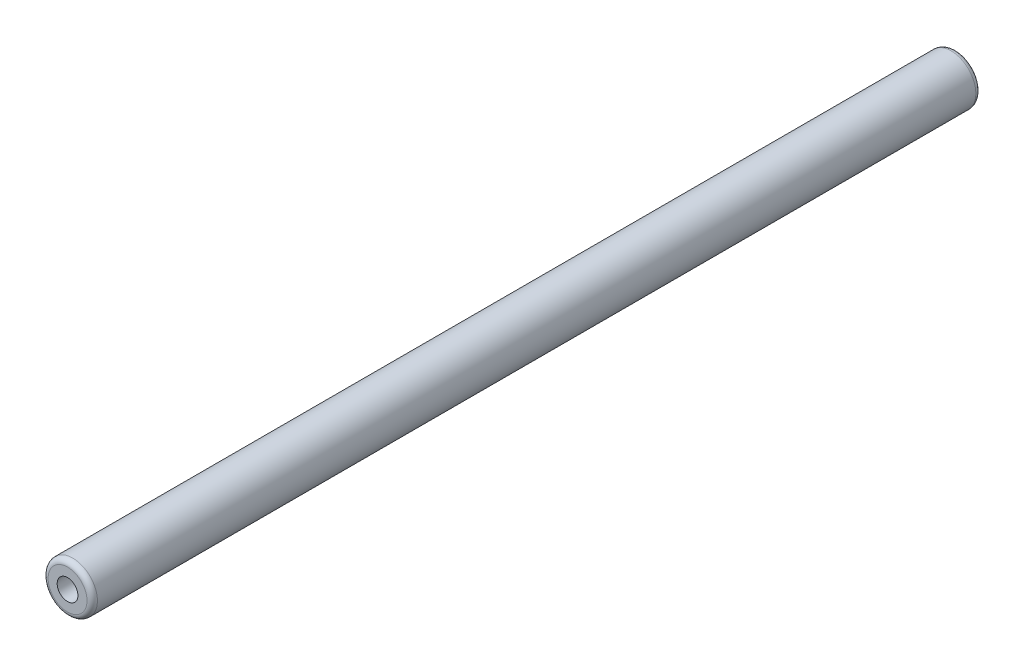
ISO-10303-21;
HEADER;
FILE_DESCRIPTION(('STEP AP214'),'2;1');
FILE_NAME('part.step','',(''),(''),'','','');
FILE_SCHEMA(('AUTOMOTIVE_DESIGN { 1 0 10303 214 1 1 1 1 }'));
ENDSEC;
DATA;
#1=APPLICATION_CONTEXT('core data for automotive mechanical design processes');
#2=APPLICATION_PROTOCOL_DEFINITION('international standard','automotive_design',2000,#1);
#3=PRODUCT_CONTEXT('',#1,'mechanical');
#4=PRODUCT('Part','Part','',(#3));
#5=PRODUCT_RELATED_PRODUCT_CATEGORY('part','',(#4));
#6=PRODUCT_DEFINITION_FORMATION('','',#4);
#7=PRODUCT_DEFINITION_CONTEXT('part definition',#1,'design');
#8=PRODUCT_DEFINITION('design','',#6,#7);
#9=PRODUCT_DEFINITION_SHAPE('','',#8);
#10=(LENGTH_UNIT() NAMED_UNIT(*) SI_UNIT(.MILLI.,.METRE.));
#11=(NAMED_UNIT(*) PLANE_ANGLE_UNIT() SI_UNIT($,.RADIAN.));
#12=(NAMED_UNIT(*) SI_UNIT($,.STERADIAN.) SOLID_ANGLE_UNIT());
#13=UNCERTAINTY_MEASURE_WITH_UNIT(LENGTH_MEASURE(1.E-05),#10,'distance_accuracy_value','');
#14=(GEOMETRIC_REPRESENTATION_CONTEXT(3) GLOBAL_UNCERTAINTY_ASSIGNED_CONTEXT((#13)) GLOBAL_UNIT_ASSIGNED_CONTEXT((#10,
#11,#12)) REPRESENTATION_CONTEXT('',''));
#15=CARTESIAN_POINT('',(0.,0.,0.));
#16=DIRECTION('',(0.,0.,1.));
#17=DIRECTION('',(1.,0.,0.));
#18=AXIS2_PLACEMENT_3D('',#15,#16,#17);
#19=CARTESIAN_POINT('',(0.,0.,171.25));
#20=DIRECTION('',(0.,0.,-1.));
#21=DIRECTION('',(-1.,0.,0.));
#22=AXIS2_PLACEMENT_3D('',#19,#20,#21);
#23=CYLINDRICAL_SURFACE('',#22,9.5);
#24=CARTESIAN_POINT('',(0.,0.,-169.25));
#25=DIRECTION('',(0.,0.,1.));
#26=DIRECTION('',(1.,0.,0.));
#27=AXIS2_PLACEMENT_3D('',#24,#25,#26);
#28=CIRCLE('',#27,9.5);
#29=CARTESIAN_POINT('',(9.5,0.,-169.25));
#30=VERTEX_POINT('',#29);
#31=EDGE_CURVE('E24',#30,#30,#28,.T.);
#32=ORIENTED_EDGE('',*,*,#31,.T.);
#33=EDGE_LOOP('',(#32));
#34=FACE_BOUND('',#33,.T.);
#35=CARTESIAN_POINT('',(0.,0.,169.25));
#36=DIRECTION('',(0.,0.,1.));
#37=DIRECTION('',(1.,0.,0.));
#38=AXIS2_PLACEMENT_3D('',#35,#36,#37);
#39=CIRCLE('',#38,9.5);
#40=CARTESIAN_POINT('',(9.5,0.,169.25));
#41=VERTEX_POINT('',#40);
#42=EDGE_CURVE('E28',#41,#41,#39,.F.);
#43=ORIENTED_EDGE('',*,*,#42,.T.);
#44=EDGE_LOOP('',(#43));
#45=FACE_BOUND('',#44,.T.);
#46=ADVANCED_FACE('F14',(#34,#45),#23,.T.);
#47=CARTESIAN_POINT('',(0.,0.,171.25));
#48=DIRECTION('',(0.,0.,1.));
#49=DIRECTION('',(1.,0.,0.));
#50=AXIS2_PLACEMENT_3D('',#47,#48,#49);
#51=PLANE('',#50);
#52=CARTESIAN_POINT('',(0.,0.,171.25));
#53=DIRECTION('',(0.,0.,1.));
#54=DIRECTION('',(1.,0.,0.));
#55=AXIS2_PLACEMENT_3D('',#52,#53,#54);
#56=CIRCLE('',#55,7.5);
#57=CARTESIAN_POINT('',(7.5,0.,171.25));
#58=VERTEX_POINT('',#57);
#59=EDGE_CURVE('E10',#58,#58,#56,.T.);
#60=ORIENTED_EDGE('',*,*,#59,.T.);
#61=EDGE_LOOP('',(#60));
#62=FACE_BOUND('',#61,.T.);
#63=CARTESIAN_POINT('',(0.,0.,171.25));
#64=DIRECTION('',(0.,0.,1.));
#65=DIRECTION('',(1.,0.,0.));
#66=AXIS2_PLACEMENT_3D('',#63,#64,#65);
#67=CIRCLE('',#66,4.);
#68=CARTESIAN_POINT('',(4.,0.,171.25));
#69=VERTEX_POINT('',#68);
#70=EDGE_CURVE('E36',#69,#69,#67,.T.);
#71=ORIENTED_EDGE('',*,*,#70,.F.);
#72=EDGE_LOOP('',(#71));
#73=FACE_BOUND('',#72,.T.);
#74=ADVANCED_FACE('F51',(#62,#73),#51,.T.);
#75=CARTESIAN_POINT('',(0.,0.,-171.25));
#76=DIRECTION('',(0.,0.,1.));
#77=DIRECTION('',(1.,0.,0.));
#78=AXIS2_PLACEMENT_3D('',#75,#76,#77);
#79=PLANE('',#78);
#80=CARTESIAN_POINT('',(0.,0.,-171.25));
#81=DIRECTION('',(0.,0.,-1.));
#82=DIRECTION('',(-1.,0.,0.));
#83=AXIS2_PLACEMENT_3D('',#80,#81,#82);
#84=CIRCLE('',#83,4.);
#85=CARTESIAN_POINT('',(-4.,0.,-171.25));
#86=VERTEX_POINT('',#85);
#87=EDGE_CURVE('E42',#86,#86,#84,.T.);
#88=ORIENTED_EDGE('',*,*,#87,.F.);
#89=EDGE_LOOP('',(#88));
#90=FACE_BOUND('',#89,.T.);
#91=CARTESIAN_POINT('',(0.,0.,-171.25));
#92=DIRECTION('',(0.,0.,1.));
#93=DIRECTION('',(1.,0.,0.));
#94=AXIS2_PLACEMENT_3D('',#91,#92,#93);
#95=CIRCLE('',#94,7.5);
#96=CARTESIAN_POINT('',(7.5,0.,-171.25));
#97=VERTEX_POINT('',#96);
#98=EDGE_CURVE('E20',#97,#97,#95,.F.);
#99=ORIENTED_EDGE('',*,*,#98,.T.);
#100=EDGE_LOOP('',(#99));
#101=FACE_BOUND('',#100,.T.);
#102=ADVANCED_FACE('F48',(#90,#101),#79,.F.);
#103=CARTESIAN_POINT('',(0.,0.,146.25));
#104=DIRECTION('',(0.,0.,1.));
#105=DIRECTION('',(1.,0.,0.));
#106=AXIS2_PLACEMENT_3D('',#103,#104,#105);
#107=CYLINDRICAL_SURFACE('',#106,4.);
#108=CARTESIAN_POINT('',(0.,0.,146.25));
#109=DIRECTION('',(0.,0.,1.));
#110=DIRECTION('',(1.,0.,0.));
#111=AXIS2_PLACEMENT_3D('',#108,#109,#110);
#112=CIRCLE('',#111,4.);
#113=CARTESIAN_POINT('',(4.,0.,146.25));
#114=VERTEX_POINT('',#113);
#115=EDGE_CURVE('E33',#114,#114,#112,.T.);
#116=ORIENTED_EDGE('',*,*,#115,.F.);
#117=EDGE_LOOP('',(#116));
#118=FACE_BOUND('',#117,.T.);
#119=ORIENTED_EDGE('',*,*,#70,.T.);
#120=EDGE_LOOP('',(#119));
#121=FACE_BOUND('',#120,.T.);
#122=ADVANCED_FACE('F50',(#118,#121),#107,.F.);
#123=CARTESIAN_POINT('',(0.,0.,146.25));
#124=DIRECTION('',(0.,0.,1.));
#125=DIRECTION('',(1.,0.,0.));
#126=AXIS2_PLACEMENT_3D('',#123,#124,#125);
#127=PLANE('',#126);
#128=ORIENTED_EDGE('',*,*,#115,.T.);
#129=EDGE_LOOP('',(#128));
#130=FACE_BOUND('',#129,.T.);
#131=ADVANCED_FACE('F59',(#130),#127,.T.);
#132=CARTESIAN_POINT('',(0.,0.,-169.25));
#133=DIRECTION('',(0.,0.,1.));
#134=DIRECTION('',(1.,0.,0.));
#135=AXIS2_PLACEMENT_3D('',#132,#133,#134);
#136=TOROIDAL_SURFACE('',#135,7.5,2.);
#137=ORIENTED_EDGE('',*,*,#98,.F.);
#138=EDGE_LOOP('',(#137));
#139=FACE_BOUND('',#138,.T.);
#140=ORIENTED_EDGE('',*,*,#31,.F.);
#141=EDGE_LOOP('',(#140));
#142=FACE_BOUND('',#141,.T.);
#143=ADVANCED_FACE('F74',(#139,#142),#136,.T.);
#144=CARTESIAN_POINT('',(0.,0.,169.25));
#145=DIRECTION('',(0.,0.,1.));
#146=DIRECTION('',(1.,0.,0.));
#147=AXIS2_PLACEMENT_3D('',#144,#145,#146);
#148=TOROIDAL_SURFACE('',#147,7.5,2.);
#149=ORIENTED_EDGE('',*,*,#42,.F.);
#150=EDGE_LOOP('',(#149));
#151=FACE_BOUND('',#150,.T.);
#152=ORIENTED_EDGE('',*,*,#59,.F.);
#153=EDGE_LOOP('',(#152));
#154=FACE_BOUND('',#153,.T.);
#155=ADVANCED_FACE('F71',(#151,#154),#148,.T.);
#156=CARTESIAN_POINT('',(0.,0.,-146.25));
#157=DIRECTION('',(0.,0.,-1.));
#158=DIRECTION('',(-1.,0.,0.));
#159=AXIS2_PLACEMENT_3D('',#156,#157,#158);
#160=CYLINDRICAL_SURFACE('',#159,4.);
#161=CARTESIAN_POINT('',(0.,0.,-146.25));
#162=DIRECTION('',(0.,0.,-1.));
#163=DIRECTION('',(-1.,0.,0.));
#164=AXIS2_PLACEMENT_3D('',#161,#162,#163);
#165=CIRCLE('',#164,4.);
#166=CARTESIAN_POINT('',(-4.,0.,-146.25));
#167=VERTEX_POINT('',#166);
#168=EDGE_CURVE('E39',#167,#167,#165,.T.);
#169=ORIENTED_EDGE('',*,*,#168,.F.);
#170=EDGE_LOOP('',(#169));
#171=FACE_BOUND('',#170,.T.);
#172=ORIENTED_EDGE('',*,*,#87,.T.);
#173=EDGE_LOOP('',(#172));
#174=FACE_BOUND('',#173,.T.);
#175=ADVANCED_FACE('F46',(#171,#174),#160,.F.);
#176=CARTESIAN_POINT('',(0.,0.,-146.25));
#177=DIRECTION('',(0.,0.,-1.));
#178=DIRECTION('',(-1.,0.,0.));
#179=AXIS2_PLACEMENT_3D('',#176,#177,#178);
#180=PLANE('',#179);
#181=ORIENTED_EDGE('',*,*,#168,.T.);
#182=EDGE_LOOP('',(#181));
#183=FACE_BOUND('',#182,.T.);
#184=ADVANCED_FACE('F81',(#183),#180,.T.);
#185=CLOSED_SHELL('',(#46,#74,#102,#122,#131,#143,#155,#175,#184));
#186=MANIFOLD_SOLID_BREP('B1',#185);
#187=ADVANCED_BREP_SHAPE_REPRESENTATION('',(#18,#186),#14);
#188=SHAPE_DEFINITION_REPRESENTATION(#9,#187);
ENDSEC;
END-ISO-10303-21;
